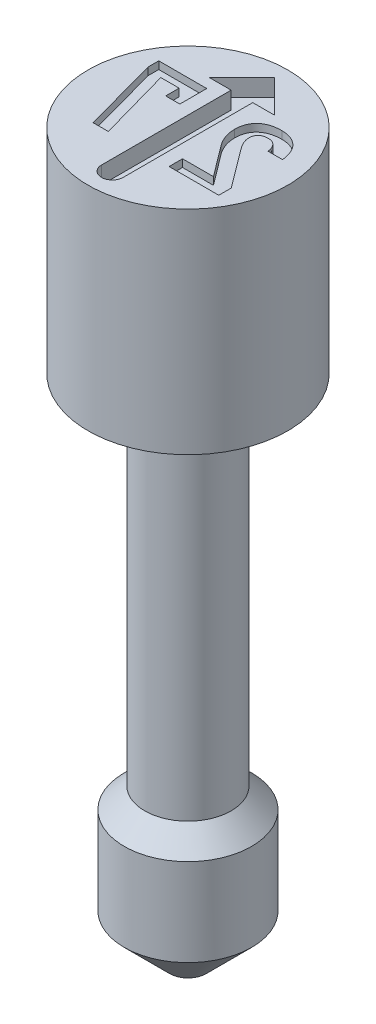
from build123d import *

# Parameters (mm, degrees)
CUT_EXTRUDE1_DEPTH = 0.4064
CUT_EXTRUDE2_DEPTH = 0.1778


with BuildPart() as part:
    # Sketch1 → Revolve1 (revolve)
    with BuildSketch(Plane.XY, mode=Mode.PRIVATE) as revolve1_sk:
        Polygon((0, 17.018), (2.3495, 17.018), (2.3495, 12.0142), (1.016, 12.0142), (1.016, 3.6068), (1.4986, 3.1242), (1.4986, 1.0668), (0.4318, 0), (0, 0), align=None)
    revolve(revolve1_sk.sketch.rotate(Axis((0, 0, 0), (0, 1, 0)), 90), axis=Axis((0, 0, 0), (0, 1, 0)))

    # Sketch2 → Cut-Extrude1 (cut)
    with BuildSketch(Plane(origin=(0, 17.018, 0), x_dir=(1, 0, 0), z_dir=(0, 1, 0))):
        with BuildLine():
            Line((0.254, -1.778), (0.254, 1.27))
            Line((0.254, 1.27), (0.762, 1.27))
            Line((0.762, 1.27), (0, 2.032))
            Line((0, 2.032), (-0.762, 1.27))
            Line((-0.762, 1.27), (-0.254, 1.27))
            Line((-0.254, 1.27), (-0.254, -1.778))
            ThreePointArc((-0.254, -1.778), (0, -2.032), (0.254, -1.778))
        make_face()
    extrude(amount=-CUT_EXTRUDE1_DEPTH, mode=Mode.SUBTRACT)

    # Sketch4 → Cut-Extrude2 (cut)
    with BuildSketch(Plane(origin=(0, 17.018, 0), x_dir=(1, 0, 0), z_dir=(0, 1, 0))):
        with BuildLine():
            Line((1.74088961, -1.016), (1.74088961, -0.722827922))
            Line((1.74088961, -0.722827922), (1.04074026, 0.215652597))
            add(Edge.make_bspline(
                [(1.04074026, 0.215652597), (1.032076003, 0.227648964), (1.014990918, 0.251304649), (0.992128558, 0.288084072), (0.972869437, 0.325721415), (0.956261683, 0.363521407), (0.943253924, 0.401045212), (0.933426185, 0.437499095), (0.928004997, 0.472789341), (0.927009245, 0.495889), (0.926522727, 0.507175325)],
                knots=[0, 0, 0, 0, 1.116221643, 2.201082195, 3.263105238, 4.303340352, 5.313368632, 6.256511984, 7.148144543, 8, 8, 8, 8], degree=3))
            Line((0.926522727, 0.507175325), (0.926522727, 0.510061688))
            add(Edge.make_bspline(
                [(0.926522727, 0.510061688), (0.927078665, 0.526368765), (0.928141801, 0.557553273), (0.94047293, 0.601204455), (0.960073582, 0.639185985), (0.988022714, 0.670613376), (1.022796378, 0.695622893), (1.064342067, 0.713667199), (1.112436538, 0.723610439), (1.146528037, 0.7249896), (1.164441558, 0.725714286)],
                knots=[0, 0, 0, 0, 1.070617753, 2.047374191, 2.957911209, 3.861726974, 4.788257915, 5.756429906, 6.821106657, 8, 8, 8, 8], degree=3))
            add(Edge.make_bspline(
                [(1.164441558, 0.725714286), (1.18158948, 0.725074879), (1.214793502, 0.723836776), (1.261924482, 0.709847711), (1.30465343, 0.688354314), (1.341471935, 0.657296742), (1.372417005, 0.618583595), (1.396947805, 0.57251723), (1.414122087, 0.518966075), (1.420208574, 0.48062153), (1.42338961, 0.460581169)],
                knots=[0, 0, 0, 0, 0.999891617, 1.936119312, 2.849186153, 3.779495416, 4.728470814, 5.731748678, 6.81452301, 8, 8, 8, 8], degree=3))
            Line((1.42338961, 0.460581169), (1.42338961, 0.459344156))
            Line((1.42338961, 0.459344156), (1.76562987, 0.459344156))
            Line((1.76562987, 0.459344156), (1.76562987, 0.460581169))
            add(Edge.make_bspline(
                [(1.76562987, 0.460581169), (1.762992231, 0.483184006), (1.757844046, 0.52730058), (1.743841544, 0.590874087), (1.726708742, 0.650658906), (1.705244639, 0.706576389), (1.679630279, 0.758546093), (1.650437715, 0.806952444), (1.616209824, 0.85063247), (1.578861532, 0.89089099), (1.537435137, 0.92627448), (1.493134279, 0.957382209), (1.44596818, 0.983940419), (1.39578374, 1.005480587), (1.342658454, 1.021877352), (1.286803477, 1.033907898), (1.227982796, 1.040924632), (1.187826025, 1.041894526), (1.167327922, 1.04238961)],
                knots=[0, 0, 0, 0, 1.176458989, 2.296231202, 3.362707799, 4.39127888, 5.389699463, 6.356664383, 7.309489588, 8.255125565, 9.192870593, 10.121896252, 11.051411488, 11.987780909, 12.941242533, 13.922967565, 14.939774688, 16, 16, 16, 16], degree=3))
            add(Edge.make_bspline(
                [(1.167327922, 1.04238961), (1.144630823, 1.042059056), (1.100508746, 1.041416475), (1.036438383, 1.034579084), (0.976258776, 1.024078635), (0.92002113, 1.008913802), (0.867836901, 0.989080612), (0.819657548, 0.964997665), (0.775168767, 0.937016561), (0.735030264, 0.904188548), (0.699184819, 0.867564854), (0.667824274, 0.827280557), (0.641938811, 0.78298736), (0.619676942, 0.735578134), (0.603562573, 0.684023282), (0.591433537, 0.629288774), (0.584492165, 0.570852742), (0.583536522, 0.530696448), (0.583045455, 0.510061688)],
                knots=[0, 0, 0, 0, 1.211483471, 2.355066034, 3.436186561, 4.470562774, 5.460097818, 6.411901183, 7.342329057, 8.260432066, 9.17382984, 10.073682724, 10.9786387, 11.907937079, 12.864144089, 13.855989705, 14.898276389, 16, 16, 16, 16], degree=3))
            Line((0.583045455, 0.510061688), (0.583045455, 0.508824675))
            add(Edge.make_bspline(
                [(0.583045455, 0.508824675), (0.583586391, 0.488036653), (0.584672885, 0.446283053), (0.594069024, 0.383460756), (0.607637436, 0.319985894), (0.628261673, 0.256774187), (0.653100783, 0.194185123), (0.683386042, 0.133645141), (0.71794772, 0.074974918), (0.744778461, 0.038273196), (0.758288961, 0.019792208)],
                knots=[0, 0, 0, 0, 0.943703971, 1.895468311, 2.880041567, 3.888955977, 4.911454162, 5.936103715, 6.960734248, 8, 8, 8, 8], degree=3))
            Line((0.758288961, 0.019792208), (1.299688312, -0.699324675))
            Line((1.299688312, -0.699324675), (0.571912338, -0.699324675))
            Line((0.571912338, -0.699324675), (0.571912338, -1.016))
            Line((0.571912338, -1.016), (1.74088961, -1.016))
        make_face()
        Polygon((-1.702641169, 1.016), (-1.702641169, 0.764474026), (-1.214021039, -1.016), (-0.856524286, -1.016), (-1.337722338, 0.699324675), (-0.906417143, 0.699324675), (-0.906417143, 0.382649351), (-0.574072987, 0.382649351), (-0.574072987, 1.016), align=None)
    extrude(amount=-CUT_EXTRUDE2_DEPTH, mode=Mode.SUBTRACT)


solid = part.part
